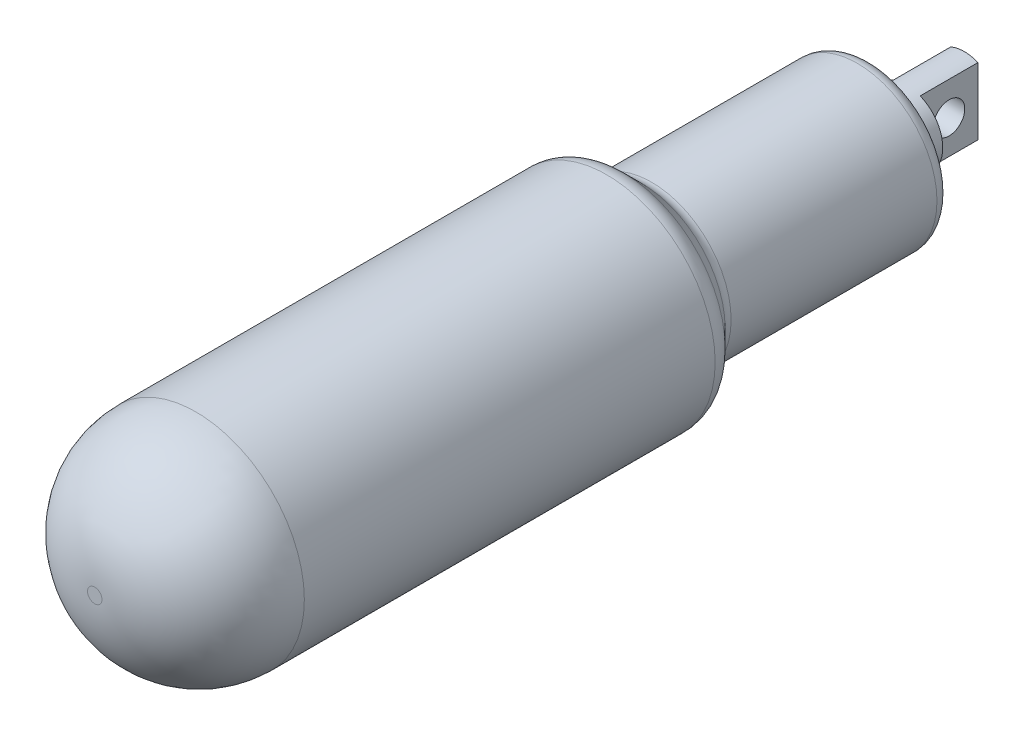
ISO-10303-21;
HEADER;
FILE_DESCRIPTION(('STEP AP214'),'2;1');
FILE_NAME('part.step','',(''),(''),'','','');
FILE_SCHEMA(('AUTOMOTIVE_DESIGN { 1 0 10303 214 1 1 1 1 }'));
ENDSEC;
DATA;
#1=APPLICATION_CONTEXT('core data for automotive mechanical design processes');
#2=APPLICATION_PROTOCOL_DEFINITION('international standard','automotive_design',2000,#1);
#3=PRODUCT_CONTEXT('',#1,'mechanical');
#4=PRODUCT('Part','Part','',(#3));
#5=PRODUCT_RELATED_PRODUCT_CATEGORY('part','',(#4));
#6=PRODUCT_DEFINITION_FORMATION('','',#4);
#7=PRODUCT_DEFINITION_CONTEXT('part definition',#1,'design');
#8=PRODUCT_DEFINITION('design','',#6,#7);
#9=PRODUCT_DEFINITION_SHAPE('','',#8);
#10=(LENGTH_UNIT() NAMED_UNIT(*) SI_UNIT(.MILLI.,.METRE.));
#11=(NAMED_UNIT(*) PLANE_ANGLE_UNIT() SI_UNIT($,.RADIAN.));
#12=(NAMED_UNIT(*) SI_UNIT($,.STERADIAN.) SOLID_ANGLE_UNIT());
#13=UNCERTAINTY_MEASURE_WITH_UNIT(LENGTH_MEASURE(1.E-05),#10,'distance_accuracy_value','');
#14=(GEOMETRIC_REPRESENTATION_CONTEXT(3) GLOBAL_UNCERTAINTY_ASSIGNED_CONTEXT((#13)) GLOBAL_UNIT_ASSIGNED_CONTEXT((#10,
#11,#12)) REPRESENTATION_CONTEXT('',''));
#15=CARTESIAN_POINT('',(0.,0.,0.));
#16=DIRECTION('',(0.,0.,1.));
#17=DIRECTION('',(1.,0.,0.));
#18=AXIS2_PLACEMENT_3D('',#15,#16,#17);
#19=CARTESIAN_POINT('',(0.,0.,-2.3999951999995));
#20=DIRECTION('',(0.,0.,1.));
#21=DIRECTION('',(1.,0.,0.));
#22=AXIS2_PLACEMENT_3D('',#19,#20,#21);
#23=CYLINDRICAL_SURFACE('',#22,2.99999997);
#24=CARTESIAN_POINT('',(0.,0.,5.2800048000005));
#25=DIRECTION('',(0.,0.,1.));
#26=DIRECTION('',(1.,0.,0.));
#27=AXIS2_PLACEMENT_3D('',#24,#25,#26);
#28=CIRCLE('',#27,2.99999997);
#29=CARTESIAN_POINT('',(2.99999997,0.,5.2800048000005));
#30=VERTEX_POINT('',#29);
#31=EDGE_CURVE('E99',#30,#30,#28,.T.);
#32=ORIENTED_EDGE('',*,*,#31,.F.);
#33=EDGE_LOOP('',(#32));
#34=FACE_BOUND('',#33,.T.);
#35=DIRECTION('',(0.,0.,1.));
#36=VECTOR('',#35,1.);
#37=CARTESIAN_POINT('',(-1.12598434,-2.7806760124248,-2.3999951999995));
#38=LINE('',#37,#36);
#39=CARTESIAN_POINT('',(-1.12598434,-2.7806760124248,-2.3999951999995));
#40=VERTEX_POINT('',#39);
#41=CARTESIAN_POINT('',(-1.12598434,-2.7806760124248,2.4000035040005));
#42=VERTEX_POINT('',#41);
#43=EDGE_CURVE('E105',#40,#42,#38,.T.);
#44=ORIENTED_EDGE('',*,*,#43,.F.);
#45=CARTESIAN_POINT('',(0.,0.,-2.3999951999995));
#46=DIRECTION('',(0.,0.,1.));
#47=DIRECTION('',(1.,0.,0.));
#48=AXIS2_PLACEMENT_3D('',#45,#46,#47);
#49=CIRCLE('',#48,2.99999997);
#50=CARTESIAN_POINT('',(1.12598434,-2.7806760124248,-2.3999951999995));
#51=VERTEX_POINT('',#50);
#52=EDGE_CURVE('E104',#40,#51,#49,.T.);
#53=ORIENTED_EDGE('',*,*,#52,.T.);
#54=DIRECTION('',(0.,0.,1.));
#55=VECTOR('',#54,1.);
#56=CARTESIAN_POINT('',(1.12598434,-2.7806760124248,-2.3999951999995));
#57=LINE('',#56,#55);
#58=CARTESIAN_POINT('',(1.12598434,-2.7806760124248,2.4000035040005));
#59=VERTEX_POINT('',#58);
#60=EDGE_CURVE('E29',#59,#51,#57,.F.);
#61=ORIENTED_EDGE('',*,*,#60,.F.);
#62=CARTESIAN_POINT('',(0.,0.,2.4000035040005));
#63=DIRECTION('',(0.,0.,-1.));
#64=DIRECTION('',(-1.,0.,0.));
#65=AXIS2_PLACEMENT_3D('',#62,#63,#64);
#66=CIRCLE('',#65,2.99999997);
#67=CARTESIAN_POINT('',(1.12598434,2.7806760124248,2.4000035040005));
#68=VERTEX_POINT('',#67);
#69=EDGE_CURVE('E22',#68,#59,#66,.T.);
#70=ORIENTED_EDGE('',*,*,#69,.F.);
#71=DIRECTION('',(0.,0.,1.));
#72=VECTOR('',#71,1.);
#73=CARTESIAN_POINT('',(1.12598434,2.7806760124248,-2.3999951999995));
#74=LINE('',#73,#72);
#75=CARTESIAN_POINT('',(1.12598434,2.7806760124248,-2.3999951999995));
#76=VERTEX_POINT('',#75);
#77=EDGE_CURVE('E54',#76,#68,#74,.T.);
#78=ORIENTED_EDGE('',*,*,#77,.F.);
#79=CARTESIAN_POINT('',(-1.12598434,2.7806760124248,-2.3999951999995));
#80=VERTEX_POINT('',#79);
#81=EDGE_CURVE('E102',#76,#80,#49,.T.);
#82=ORIENTED_EDGE('',*,*,#81,.T.);
#83=DIRECTION('',(0.,0.,1.));
#84=VECTOR('',#83,1.);
#85=CARTESIAN_POINT('',(-1.12598434,2.7806760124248,-2.3999951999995));
#86=LINE('',#85,#84);
#87=CARTESIAN_POINT('',(-1.12598434,2.7806760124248,2.4000035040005));
#88=VERTEX_POINT('',#87);
#89=EDGE_CURVE('E37',#88,#80,#86,.F.);
#90=ORIENTED_EDGE('',*,*,#89,.F.);
#91=CARTESIAN_POINT('',(0.,0.,2.4000035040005));
#92=DIRECTION('',(0.,0.,-1.));
#93=DIRECTION('',(-1.,0.,0.));
#94=AXIS2_PLACEMENT_3D('',#91,#92,#93);
#95=CIRCLE('',#94,2.99999997);
#96=EDGE_CURVE('E9',#42,#88,#95,.T.);
#97=ORIENTED_EDGE('',*,*,#96,.F.);
#98=EDGE_LOOP('',(#44,#53,#61,#70,#78,#82,#90,#97));
#99=FACE_BOUND('',#98,.T.);
#100=ADVANCED_FACE('F14',(#34,#99),#23,.T.);
#101=CARTESIAN_POINT('',(0.,2.99999997,-2.3999951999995));
#102=DIRECTION('',(0.,0.,1.));
#103=DIRECTION('',(1.,0.,0.));
#104=AXIS2_PLACEMENT_3D('',#101,#102,#103);
#105=PLANE('',#104);
#106=DIRECTION('',(0.,-1.,0.));
#107=VECTOR('',#106,1.);
#108=CARTESIAN_POINT('',(-1.12598434,2.99999997,-2.3999951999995));
#109=LINE('',#108,#107);
#110=EDGE_CURVE('E71',#80,#40,#109,.T.);
#111=ORIENTED_EDGE('',*,*,#110,.F.);
#112=ORIENTED_EDGE('',*,*,#81,.F.);
#113=DIRECTION('',(0.,1.,0.));
#114=VECTOR('',#113,1.);
#115=CARTESIAN_POINT('',(1.12598434,2.99999997,-2.3999951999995));
#116=LINE('',#115,#114);
#117=EDGE_CURVE('E58',#51,#76,#116,.T.);
#118=ORIENTED_EDGE('',*,*,#117,.F.);
#119=ORIENTED_EDGE('',*,*,#52,.F.);
#120=EDGE_LOOP('',(#111,#112,#118,#119));
#121=FACE_BOUND('',#120,.T.);
#122=ADVANCED_FACE('F127',(#121),#105,.F.);
#123=CARTESIAN_POINT('',(0.,0.,69.8000025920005));
#124=DIRECTION('',(0.,0.,-1.));
#125=DIRECTION('',(-1.,0.,0.));
#126=AXIS2_PLACEMENT_3D('',#123,#124,#125);
#127=PLANE('',#126);
#128=CARTESIAN_POINT('',(0.,0.,69.8000025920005));
#129=DIRECTION('',(0.,0.,1.));
#130=DIRECTION('',(1.,0.,0.));
#131=AXIS2_PLACEMENT_3D('',#128,#129,#130);
#132=CIRCLE('',#131,0.600000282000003);
#133=CARTESIAN_POINT('',(0.600000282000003,0.,69.8000025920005));
#134=VERTEX_POINT('',#133);
#135=EDGE_CURVE('E75',#134,#134,#132,.T.);
#136=ORIENTED_EDGE('',*,*,#135,.T.);
#137=EDGE_LOOP('',(#136));
#138=FACE_BOUND('',#137,.T.);
#139=ADVANCED_FACE('F16',(#138),#127,.F.);
#140=CARTESIAN_POINT('',(0.,0.,61.4000026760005));
#141=DIRECTION('',(0.,0.,1.));
#142=DIRECTION('',(1.,0.,0.));
#143=AXIS2_PLACEMENT_3D('',#140,#141,#142);
#144=DEGENERATE_TOROIDAL_SURFACE('',#143,0.600000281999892,8.3999999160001,.T.);
#145=ORIENTED_EDGE('',*,*,#135,.F.);
#146=EDGE_LOOP('',(#145));
#147=FACE_BOUND('',#146,.T.);
#148=CARTESIAN_POINT('',(0.,0.,61.4000026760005));
#149=DIRECTION('',(0.,0.,1.));
#150=DIRECTION('',(1.,0.,0.));
#151=AXIS2_PLACEMENT_3D('',#148,#149,#150);
#152=CIRCLE('',#151,9.000000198);
#153=CARTESIAN_POINT('',(9.000000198,0.,61.4000026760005));
#154=VERTEX_POINT('',#153);
#155=EDGE_CURVE('E78',#154,#154,#152,.T.);
#156=ORIENTED_EDGE('',*,*,#155,.T.);
#157=EDGE_LOOP('',(#156));
#158=FACE_BOUND('',#157,.T.);
#159=ADVANCED_FACE('F136',(#147,#158),#144,.T.);
#160=CARTESIAN_POINT('',(0.,0.,-2.3999951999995));
#161=DIRECTION('',(0.,0.,1.));
#162=DIRECTION('',(1.,0.,0.));
#163=AXIS2_PLACEMENT_3D('',#160,#161,#162);
#164=CYLINDRICAL_SURFACE('',#163,9.000000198);
#165=ORIENTED_EDGE('',*,*,#155,.F.);
#166=EDGE_LOOP('',(#165));
#167=FACE_BOUND('',#166,.T.);
#168=CARTESIAN_POINT('',(0.,0.,27.2950963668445));
#169=DIRECTION('',(0.,0.,1.));
#170=DIRECTION('',(1.,0.,0.));
#171=AXIS2_PLACEMENT_3D('',#168,#169,#170);
#172=CIRCLE('',#171,9.000000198);
#173=CARTESIAN_POINT('',(9.000000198,0.,27.2950963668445));
#174=VERTEX_POINT('',#173);
#175=EDGE_CURVE('E81',#174,#174,#172,.T.);
#176=ORIENTED_EDGE('',*,*,#175,.T.);
#177=EDGE_LOOP('',(#176));
#178=FACE_BOUND('',#177,.T.);
#179=ADVANCED_FACE('F165',(#167,#178),#164,.T.);
#180=CARTESIAN_POINT('',(0.,0.,27.2950963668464));
#181=DIRECTION('',(0.,0.,1.));
#182=DIRECTION('',(1.,0.,0.));
#183=AXIS2_PLACEMENT_3D('',#180,#181,#182);
#184=TOROIDAL_SURFACE('',#183,7.00000023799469,1.99999996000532);
#185=ORIENTED_EDGE('',*,*,#175,.F.);
#186=EDGE_LOOP('',(#185));
#187=FACE_BOUND('',#186,.T.);
#188=CARTESIAN_POINT('',(0.,0.,25.8808828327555));
#189=DIRECTION('',(0.,0.,1.));
#190=DIRECTION('',(1.,0.,0.));
#191=AXIS2_PLACEMENT_3D('',#188,#189,#190);
#192=CIRCLE('',#191,8.414213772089);
#193=CARTESIAN_POINT('',(8.414213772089,0.,25.8808828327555));
#194=VERTEX_POINT('',#193);
#195=EDGE_CURVE('E84',#194,#194,#192,.T.);
#196=ORIENTED_EDGE('',*,*,#195,.T.);
#197=EDGE_LOOP('',(#196));
#198=FACE_BOUND('',#197,.T.);
#199=ADVANCED_FACE('F161',(#187,#198),#184,.T.);
#200=CARTESIAN_POINT('',(0.,0.,24.4181413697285));
#201=DIRECTION('',(0.,0.,1.));
#202=DIRECTION('',(1.,0.,0.));
#203=AXIS2_PLACEMENT_3D('',#200,#201,#202);
#204=CONICAL_SURFACE('',#203,6.951472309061,0.785398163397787);
#205=ORIENTED_EDGE('',*,*,#195,.F.);
#206=EDGE_LOOP('',(#205));
#207=FACE_BOUND('',#206,.T.);
#208=CARTESIAN_POINT('',(0.,0.,24.4181413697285));
#209=DIRECTION('',(0.,0.,1.));
#210=DIRECTION('',(1.,0.,0.));
#211=AXIS2_PLACEMENT_3D('',#208,#209,#210);
#212=CIRCLE('',#211,6.951472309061);
#213=CARTESIAN_POINT('',(6.951472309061,0.,24.4181413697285));
#214=VERTEX_POINT('',#213);
#215=EDGE_CURVE('E87',#214,#214,#212,.T.);
#216=ORIENTED_EDGE('',*,*,#215,.T.);
#217=EDGE_LOOP('',(#216));
#218=FACE_BOUND('',#217,.T.);
#219=ADVANCED_FACE('F157',(#207,#218),#204,.T.);
#220=CARTESIAN_POINT('',(0.,0.,23.5696132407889));
#221=DIRECTION('',(0.,0.,1.));
#222=DIRECTION('',(1.,0.,0.));
#223=AXIS2_PLACEMENT_3D('',#220,#221,#222);
#224=TOROIDAL_SURFACE('',#223,7.8000004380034,1.1999999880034);
#225=ORIENTED_EDGE('',*,*,#215,.F.);
#226=EDGE_LOOP('',(#225));
#227=FACE_BOUND('',#226,.T.);
#228=CARTESIAN_POINT('',(0.,0.,23.5696132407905));
#229=DIRECTION('',(0.,0.,1.));
#230=DIRECTION('',(1.,0.,0.));
#231=AXIS2_PLACEMENT_3D('',#228,#229,#230);
#232=CIRCLE('',#231,6.60000045);
#233=CARTESIAN_POINT('',(6.60000045,0.,23.5696132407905));
#234=VERTEX_POINT('',#233);
#235=EDGE_CURVE('E90',#234,#234,#232,.T.);
#236=ORIENTED_EDGE('',*,*,#235,.T.);
#237=EDGE_LOOP('',(#236));
#238=FACE_BOUND('',#237,.T.);
#239=ADVANCED_FACE('F153',(#227,#238),#224,.F.);
#240=CARTESIAN_POINT('',(0.,0.,-2.3999951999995));
#241=DIRECTION('',(0.,0.,1.));
#242=DIRECTION('',(1.,0.,0.));
#243=AXIS2_PLACEMENT_3D('',#240,#241,#242);
#244=CYLINDRICAL_SURFACE('',#243,6.60000045);
#245=ORIENTED_EDGE('',*,*,#235,.F.);
#246=EDGE_LOOP('',(#245));
#247=FACE_BOUND('',#246,.T.);
#248=CARTESIAN_POINT('',(0.,0.,6.4800047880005));
#249=DIRECTION('',(0.,0.,1.));
#250=DIRECTION('',(1.,0.,0.));
#251=AXIS2_PLACEMENT_3D('',#248,#249,#250);
#252=CIRCLE('',#251,6.60000045);
#253=CARTESIAN_POINT('',(6.60000045,0.,6.4800047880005));
#254=VERTEX_POINT('',#253);
#255=EDGE_CURVE('E93',#254,#254,#252,.T.);
#256=ORIENTED_EDGE('',*,*,#255,.T.);
#257=EDGE_LOOP('',(#256));
#258=FACE_BOUND('',#257,.T.);
#259=ADVANCED_FACE('F149',(#247,#258),#244,.T.);
#260=CARTESIAN_POINT('',(0.,0.,6.4800047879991));
#261=DIRECTION('',(0.,0.,1.));
#262=DIRECTION('',(1.,0.,0.));
#263=AXIS2_PLACEMENT_3D('',#260,#261,#262);
#264=TOROIDAL_SURFACE('',#263,5.40000046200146,1.19999998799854);
#265=ORIENTED_EDGE('',*,*,#255,.F.);
#266=EDGE_LOOP('',(#265));
#267=FACE_BOUND('',#266,.T.);
#268=CARTESIAN_POINT('',(0.,0.,5.2800048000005));
#269=DIRECTION('',(0.,0.,1.));
#270=DIRECTION('',(1.,0.,0.));
#271=AXIS2_PLACEMENT_3D('',#268,#269,#270);
#272=CIRCLE('',#271,5.400000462);
#273=CARTESIAN_POINT('',(5.400000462,0.,5.2800048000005));
#274=VERTEX_POINT('',#273);
#275=EDGE_CURVE('E96',#274,#274,#272,.T.);
#276=ORIENTED_EDGE('',*,*,#275,.T.);
#277=EDGE_LOOP('',(#276));
#278=FACE_BOUND('',#277,.T.);
#279=ADVANCED_FACE('F145',(#267,#278),#264,.T.);
#280=CARTESIAN_POINT('',(0.,5.400000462,5.2800048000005));
#281=DIRECTION('',(0.,0.,1.));
#282=DIRECTION('',(1.,0.,0.));
#283=AXIS2_PLACEMENT_3D('',#280,#281,#282);
#284=PLANE('',#283);
#285=ORIENTED_EDGE('',*,*,#275,.F.);
#286=EDGE_LOOP('',(#285));
#287=FACE_BOUND('',#286,.T.);
#288=ORIENTED_EDGE('',*,*,#31,.T.);
#289=EDGE_LOOP('',(#288));
#290=FACE_BOUND('',#289,.T.);
#291=ADVANCED_FACE('F142',(#287,#290),#284,.F.);
#292=CARTESIAN_POINT('',(1.12598434,26.,-4.2919964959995));
#293=DIRECTION('',(1.,0.,0.));
#294=DIRECTION('',(0.,1.,0.));
#295=AXIS2_PLACEMENT_3D('',#292,#293,#294);
#296=PLANE('',#295);
#297=CARTESIAN_POINT('',(1.12598434,0.,0.));
#298=DIRECTION('',(1.,0.,0.));
#299=DIRECTION('',(0.,1.,0.));
#300=AXIS2_PLACEMENT_3D('',#297,#298,#299);
#301=CIRCLE('',#300,1.3);
#302=CARTESIAN_POINT('',(1.12598434,1.3,0.));
#303=VERTEX_POINT('',#302);
#304=EDGE_CURVE('E67',#303,#303,#301,.T.);
#305=ORIENTED_EDGE('',*,*,#304,.F.);
#306=EDGE_LOOP('',(#305));
#307=FACE_BOUND('',#306,.T.);
#308=ORIENTED_EDGE('',*,*,#77,.T.);
#309=DIRECTION('',(0.,-1.,0.));
#310=VECTOR('',#309,1.);
#311=CARTESIAN_POINT('',(1.12598434,26.,2.4000035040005));
#312=LINE('',#311,#310);
#313=EDGE_CURVE('E57',#68,#59,#312,.T.);
#314=ORIENTED_EDGE('',*,*,#313,.T.);
#315=ORIENTED_EDGE('',*,*,#60,.T.);
#316=ORIENTED_EDGE('',*,*,#117,.T.);
#317=EDGE_LOOP('',(#308,#314,#315,#316));
#318=FACE_BOUND('',#317,.T.);
#319=ADVANCED_FACE('F56',(#307,#318),#296,.T.);
#320=CARTESIAN_POINT('',(1.12598434,26.,2.4000035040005));
#321=DIRECTION('',(0.,0.,-1.));
#322=DIRECTION('',(-1.,0.,0.));
#323=AXIS2_PLACEMENT_3D('',#320,#321,#322);
#324=PLANE('',#323);
#325=ORIENTED_EDGE('',*,*,#69,.T.);
#326=ORIENTED_EDGE('',*,*,#313,.F.);
#327=EDGE_LOOP('',(#325,#326));
#328=FACE_BOUND('',#327,.T.);
#329=ADVANCED_FACE('F65',(#328),#324,.T.);
#330=CARTESIAN_POINT('',(-3.66598434,26.,2.4000035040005));
#331=DIRECTION('',(0.,0.,-1.));
#332=DIRECTION('',(-1.,0.,0.));
#333=AXIS2_PLACEMENT_3D('',#330,#331,#332);
#334=PLANE('',#333);
#335=ORIENTED_EDGE('',*,*,#96,.T.);
#336=DIRECTION('',(0.,-1.,0.));
#337=VECTOR('',#336,1.);
#338=CARTESIAN_POINT('',(-1.12598434,26.,2.4000035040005));
#339=LINE('',#338,#337);
#340=EDGE_CURVE('E66',#88,#42,#339,.T.);
#341=ORIENTED_EDGE('',*,*,#340,.T.);
#342=EDGE_LOOP('',(#335,#341));
#343=FACE_BOUND('',#342,.T.);
#344=ADVANCED_FACE('F121',(#343),#334,.T.);
#345=CARTESIAN_POINT('',(-1.12598434,26.,2.4000035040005));
#346=DIRECTION('',(-1.,0.,0.));
#347=DIRECTION('',(0.,-1.,0.));
#348=AXIS2_PLACEMENT_3D('',#345,#346,#347);
#349=PLANE('',#348);
#350=CARTESIAN_POINT('',(-1.12598434,0.,0.));
#351=DIRECTION('',(-1.,0.,0.));
#352=DIRECTION('',(0.,-1.,0.));
#353=AXIS2_PLACEMENT_3D('',#350,#351,#352);
#354=CIRCLE('',#353,1.3);
#355=CARTESIAN_POINT('',(-1.12598434,-1.3,0.));
#356=VERTEX_POINT('',#355);
#357=EDGE_CURVE('E113',#356,#356,#354,.T.);
#358=ORIENTED_EDGE('',*,*,#357,.F.);
#359=EDGE_LOOP('',(#358));
#360=FACE_BOUND('',#359,.T.);
#361=ORIENTED_EDGE('',*,*,#43,.T.);
#362=ORIENTED_EDGE('',*,*,#340,.F.);
#363=ORIENTED_EDGE('',*,*,#89,.T.);
#364=ORIENTED_EDGE('',*,*,#110,.T.);
#365=EDGE_LOOP('',(#361,#362,#363,#364));
#366=FACE_BOUND('',#365,.T.);
#367=ADVANCED_FACE('F119',(#360,#366),#349,.T.);
#368=CARTESIAN_POINT('',(8.87401566,0.,0.));
#369=DIRECTION('',(-1.,0.,0.));
#370=DIRECTION('',(0.,-1.,0.));
#371=AXIS2_PLACEMENT_3D('',#368,#369,#370);
#372=CYLINDRICAL_SURFACE('',#371,1.3);
#373=ORIENTED_EDGE('',*,*,#304,.T.);
#374=EDGE_LOOP('',(#373));
#375=FACE_BOUND('',#374,.T.);
#376=ORIENTED_EDGE('',*,*,#357,.T.);
#377=EDGE_LOOP('',(#376));
#378=FACE_BOUND('',#377,.T.);
#379=ADVANCED_FACE('F117',(#375,#378),#372,.F.);
#380=CLOSED_SHELL('',(#100,#122,#139,#159,#179,#199,#219,#239,#259,#279,#291,#319,#329,#344,
#367,#379));
#381=MANIFOLD_SOLID_BREP('B1',#380);
#382=ADVANCED_BREP_SHAPE_REPRESENTATION('',(#18,#381),#14);
#383=SHAPE_DEFINITION_REPRESENTATION(#9,#382);
ENDSEC;
END-ISO-10303-21;
